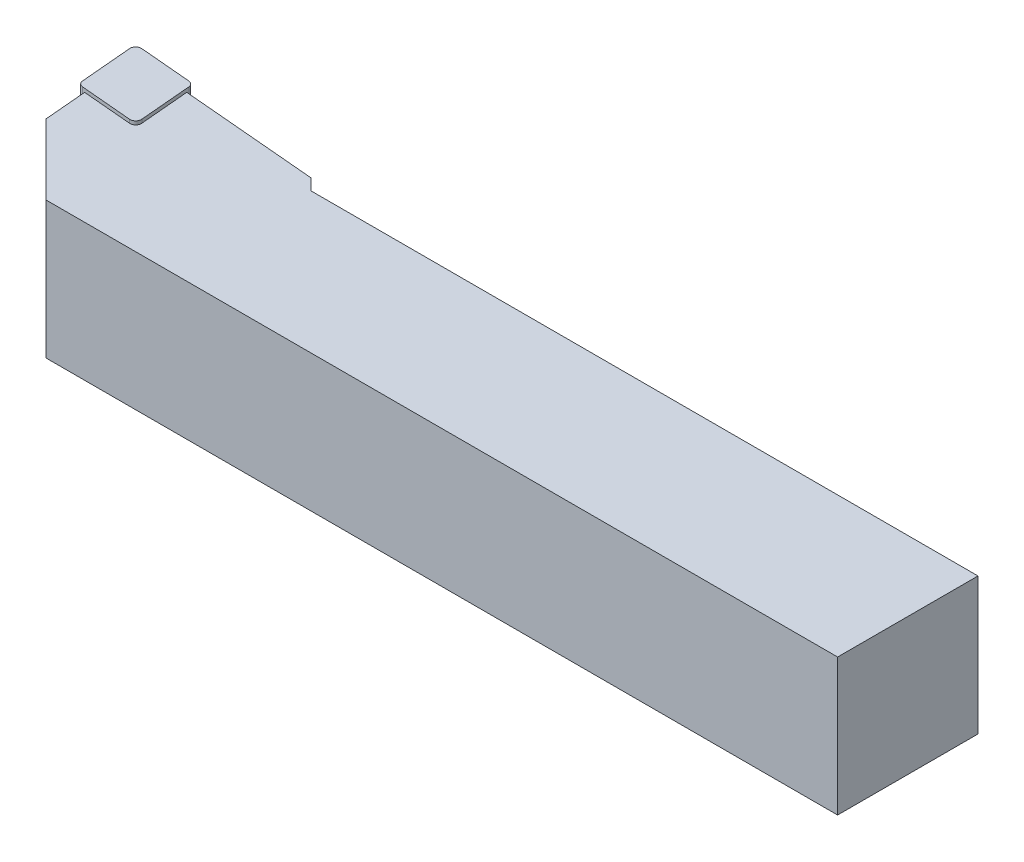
from build123d import *

# Parameters (mm, degrees)
PLAQUETTE_DEPTH  = 4.76
CORPSOUTIL_DEPTH = 19.5


with BuildPart() as part:
    # EsqPlaquette → Plaquette (new body)
    with BuildSketch(Plane(origin=(0, 0, 0), x_dir=(1, 0, 0), z_dir=(0, 1, 0))):
        with BuildLine():
            Line((0.645845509, -8.216976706), (0.003044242, -0.869724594))
            ThreePointArc((0.003044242, -0.869724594), (0.234314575, -0.234314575), (0.869724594, -0.003044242))
            Line((0.869724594, -0.003044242), (8.216976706, -0.645845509))
            ThreePointArc((8.216976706, -0.645845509), (8.712937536, -0.877115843), (8.94420787, -1.373076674))
            Line((8.94420787, -1.373076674), (9.587009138, -8.720328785))
            ThreePointArc((9.587009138, -8.720328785), (9.355738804, -9.355738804), (8.720328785, -9.587009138))
            Line((8.720328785, -9.587009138), (1.373076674, -8.94420787))
            ThreePointArc((1.373076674, -8.94420787), (0.877115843, -8.712937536), (0.645845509, -8.216976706))
        make_face()
    extrude(amount=-PLAQUETTE_DEPTH)

    # EsqCorps → CorpsOutil (add)
    with BuildSketch(Plane(origin=(0, -0.5, 0), x_dir=(-1, 0, 0), z_dir=(0, 1, 0))):
        Polygon((-125, 5), (-125, 25), (-12.224841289, 25), (-2.224841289, 15), (-1, 1), (-28.396919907, 3.396919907), (-30, 5), align=None)
    extrude(amount=-CORPSOUTIL_DEPTH)


solid = part.part
